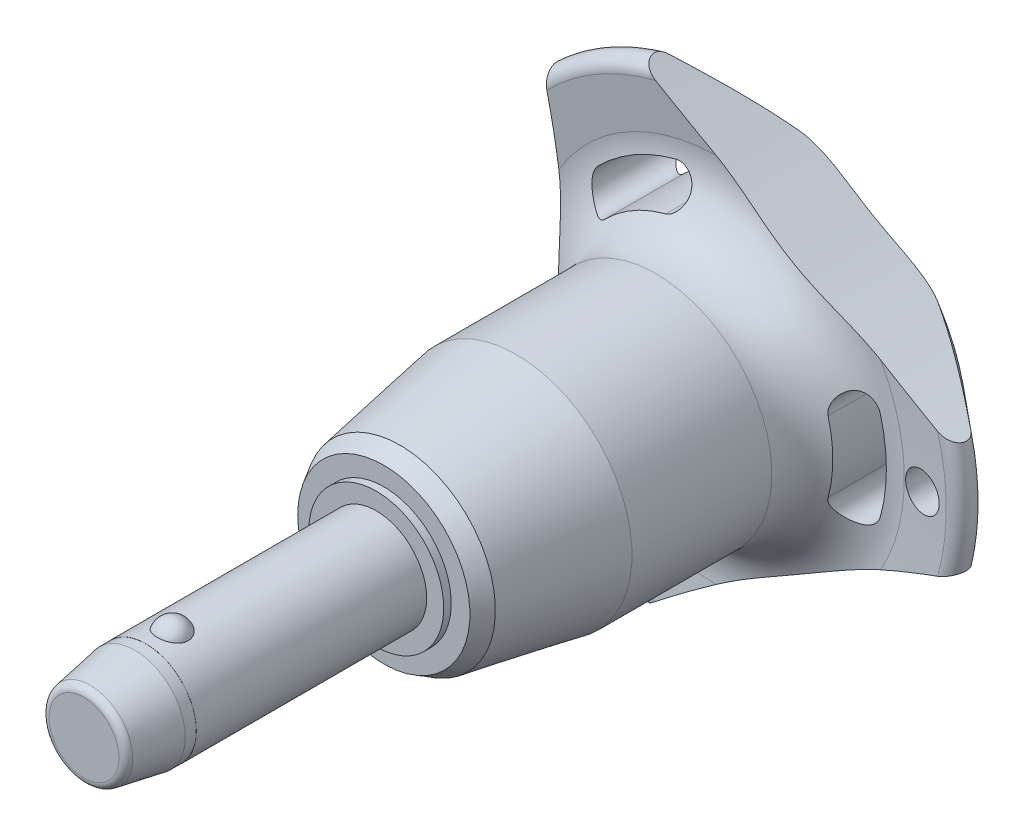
from build123d import *

# Parameters (mm, degrees)
SKETCH1_R           = 4
BOSS_EXTRUDE1_DEPTH = 15
SKETCH2_R           = 3.4
BOSS_EXTRUDE2_DEPTH = 33.3
BOSS_EXTRUDE3_START = 8.2
SKETCH1_2_R         = 4
BOSS_EXTRUDE3_DEPTH = 8.2
CHAMFER1_SIZE       = 4.1
CHAMFER1_SIZE2      = 0.722940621
FILLET1_R           = 0.6
SKETCH6_R           = 102.8
CUT_EXTRUDE1_DEPTH  = 56.691633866
CIRPATTERN1_COUNT   = 3
SKETCH7_R           = 1.5
CUT_EXTRUDE2_DEPTH  = 56.400455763
SKETCH8_R           = 4
SKETCH8_R_2         = 3.99
CUT_EXTRUDE3_DEPTH  = 4.92


with BuildPart() as part:
    # Sketch1 → Boss-Extrude1 (new body)
    with BuildSketch(Plane.XY):
        Circle(SKETCH1_R)
    extrude(amount=-BOSS_EXTRUDE1_DEPTH)

    # Sketch2 → Boss-Extrude2 (add)
    with BuildSketch(Plane(origin=(0, 0, -15), x_dir=(-1, 0, 0), z_dir=(0, 0, -1))):
        Circle(SKETCH2_R)
    extrude(amount=BOSS_EXTRUDE2_DEPTH)

    # Sketch3 → Revolve1 (revolve)
    with BuildSketch(Plane(origin=(0, 0, 0), x_dir=(0, 0, -1), z_dir=(1, 0, 0))):
        with BuildLine():
            Line((-1.2, 4.8), (-1.2, 2.2))
            ThreePointArc((-1.2, 2.2), (0.1, 3.5), (-1.2, 4.8))
        make_face()
        with BuildLine():
            Line((-1.2, -2.2), (-1.2, -4.8))
            ThreePointArc((-1.2, -4.8), (0.1, -3.5), (-1.2, -2.2))
        make_face()
    revolve(axis=Axis((0, -2.2, 1.2), (0, 1, 0)))

    # Sketch1_2 → Boss-Extrude3 (add)
    with BuildSketch(Plane.XY.offset(BOSS_EXTRUDE3_START)):
        Circle(SKETCH1_2_R)
    extrude(amount=-BOSS_EXTRUDE3_DEPTH)

    # Chamfer1
    chamfer1_edges = [part.edges().sort_by_distance(p)[0] for p in [
        (-4, 0, 8.2),
    ]]
    chamfer1_side = [part.faces().sort_by_distance(p)[0] for p in [
        (-4, 0, -3.4),
    ]]
    chamfer(chamfer1_edges, length=CHAMFER1_SIZE, length2=CHAMFER1_SIZE2, reference=chamfer1_side[0])

    # Fillet1
    fillet1_edges = [part.edges().sort_by_distance(p)[0] for p in [
        (-3.277059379, 0, 8.2),
        (3.4, 0, -48.3),
    ]]
    fillet(fillet1_edges, radius=FILLET1_R)

    # Sketch4 → Revolve2 (revolve)
    with BuildSketch(Plane(origin=(0, 0, 0), x_dir=(0, 0, -1), z_dir=(1, 0, 0)), mode=Mode.PRIVATE) as revolve2_sk:
        Polygon((15, 0), (15, 5.353660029), (15.6, 5.353660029), (15.6, 6.834334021), (16.882301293, 7.574671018), (26.1, 9.2), (37.2, 9.2), (37.2, 0), align=None)
    revolve(revolve2_sk.sketch.rotate(Axis((0, 0, -37.2), (0, 0, 1)), 90), axis=Axis((0, 0, -37.2), (0, 0, 1)))

    # Sketch5 → Revolve3 (revolve)
    with BuildSketch(Plane(origin=(0, 0, 0), x_dir=(0, 0, -1), z_dir=(1, 0, 0)), mode=Mode.PRIVATE) as revolve3_sk:
        with BuildLine():
            Line((42.169704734, 14.749576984), (41.756059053, 18.490084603))
            ThreePointArc((41.756059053, 18.490084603), (42.35677658, 19.519442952), (43.516044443, 19.24278761))
            Line((43.516044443, 19.24278761), (47.835691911, 14.094832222))
            ThreePointArc((47.835691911, 14.094832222), (48.3, 12.689260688), (47.67067517, 11.349423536))
            ThreePointArc((47.67067517, 11.349423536), (44.033110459, 6.185112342), (42.75, 0))
            Line((42.75, 0), (37.2, 0))
            Line((37.2, 0), (37.2, 9.2))
            ThreePointArc((37.2, 9.2), (40.924774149, 10.864425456), (42.169704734, 14.749576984))
        make_face()
    revolve(revolve3_sk.sketch.rotate(Axis((0, 0, -42.75), (0, 0, 1)), 90), axis=Axis((0, 0, -42.75), (0, 0, 1)))

    # Sketch6 → Cut-Extrude1 (cut, through all)
    with BuildSketch(Plane.XY):
        with Locations((-115.2, 0)):
            Circle(SKETCH6_R)
        with BuildLine():
            ThreePointArc((12.885043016, -3.538869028), (13.362182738, 0), (12.885043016, 3.538869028))
            ThreePointArc((12.885043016, 3.538869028), (11.179749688, 4.509281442), (10.209337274, 2.803988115))
            ThreePointArc((10.209337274, 2.803988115), (10.587394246, 0), (10.209337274, -2.803988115))
            ThreePointArc((10.209337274, -2.803988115), (11.179749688, -4.509281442), (12.885043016, -3.538869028))
        make_face()
    cut_extrude1 = extrude(amount=-CUT_EXTRUDE1_DEPTH, mode=Mode.SUBTRACT)

    # CirPattern1: Cut-Extrude1 ×3 about axis
    cirpattern1_axis = Axis((0, 0, 0), (0, 0, 1))
    for i in range(1, CIRPATTERN1_COUNT):
        add(cut_extrude1.rotate(cirpattern1_axis, i * 360 / CIRPATTERN1_COUNT), mode=Mode.SUBTRACT)

    # Sketch7 → Cut-Extrude2 (cut, through all)
    with BuildSketch(Plane.XY):
        with Locations(Location((16.362182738, 0, 0), (0, 0, 225.449470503))):
            Circle(SKETCH7_R)
    extrude(amount=-CUT_EXTRUDE2_DEPTH, mode=Mode.SUBTRACT)

    # Sketch8 → Cut-Extrude3 (cut)
    with BuildSketch(Plane.XY.offset(8.2)):
        Circle(SKETCH8_R)
        Circle(SKETCH8_R_2, mode=Mode.SUBTRACT)
    extrude(amount=-CUT_EXTRUDE3_DEPTH, mode=Mode.SUBTRACT)


solid = part.part
